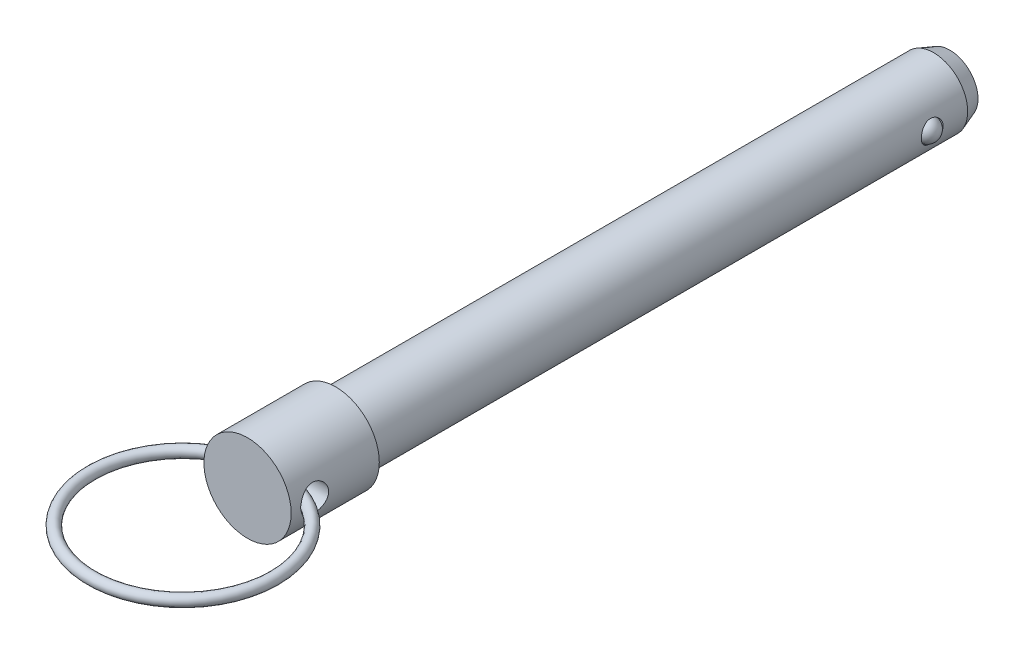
ISO-10303-21;
HEADER;
FILE_DESCRIPTION(('STEP AP214'),'2;1');
FILE_NAME('part.step','',(''),(''),'','','');
FILE_SCHEMA(('AUTOMOTIVE_DESIGN { 1 0 10303 214 1 1 1 1 }'));
ENDSEC;
DATA;
#1=APPLICATION_CONTEXT('core data for automotive mechanical design processes');
#2=APPLICATION_PROTOCOL_DEFINITION('international standard','automotive_design',2000,#1);
#3=PRODUCT_CONTEXT('',#1,'mechanical');
#4=PRODUCT('Part','Part','',(#3));
#5=PRODUCT_RELATED_PRODUCT_CATEGORY('part','',(#4));
#6=PRODUCT_DEFINITION_FORMATION('','',#4);
#7=PRODUCT_DEFINITION_CONTEXT('part definition',#1,'design');
#8=PRODUCT_DEFINITION('design','',#6,#7);
#9=PRODUCT_DEFINITION_SHAPE('','',#8);
#10=(LENGTH_UNIT() NAMED_UNIT(*) SI_UNIT(.MILLI.,.METRE.));
#11=(NAMED_UNIT(*) PLANE_ANGLE_UNIT() SI_UNIT($,.RADIAN.));
#12=(NAMED_UNIT(*) SI_UNIT($,.STERADIAN.) SOLID_ANGLE_UNIT());
#13=UNCERTAINTY_MEASURE_WITH_UNIT(LENGTH_MEASURE(1.E-05),#10,'distance_accuracy_value','');
#14=(GEOMETRIC_REPRESENTATION_CONTEXT(3) GLOBAL_UNCERTAINTY_ASSIGNED_CONTEXT((#13)) GLOBAL_UNIT_ASSIGNED_CONTEXT((#10,
#11,#12)) REPRESENTATION_CONTEXT('',''));
#15=CARTESIAN_POINT('',(0.,0.,0.));
#16=DIRECTION('',(0.,0.,1.));
#17=DIRECTION('',(1.,0.,0.));
#18=AXIS2_PLACEMENT_3D('',#15,#16,#17);
#19=CARTESIAN_POINT('',(7.9375,0.,9.398));
#20=DIRECTION('',(-1.,0.,0.));
#21=DIRECTION('',(0.,0.,-1.));
#22=AXIS2_PLACEMENT_3D('',#19,#20,#21);
#23=CYLINDRICAL_SURFACE('',#22,2.0193);
#24=CARTESIAN_POINT('',(-6.3502,0.292157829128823,11.3960531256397));
#25=CARTESIAN_POINT('',(-6.33446408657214,0.262361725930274,11.4004344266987));
#26=CARTESIAN_POINT('',(-6.32102794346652,0.231225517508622,11.4042829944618));
#27=CARTESIAN_POINT('',(-6.2992523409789,0.167152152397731,11.4106204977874));
#28=CARTESIAN_POINT('',(-6.29090461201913,0.134218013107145,11.413111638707));
#29=CARTESIAN_POINT('',(-6.2797291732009,0.0672091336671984,11.4164621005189));
#30=CARTESIAN_POINT('',(-6.27692077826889,0.033130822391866,11.4173157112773));
#31=CARTESIAN_POINT('',(-6.27702601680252,-0.0350157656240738,11.4172838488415));
#32=CARTESIAN_POINT('',(-6.27993956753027,-0.0690840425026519,11.4163984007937));
#33=CARTESIAN_POINT('',(-6.29126629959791,-0.135748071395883,11.4130038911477));
#34=CARTESIAN_POINT('',(-6.2996097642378,-0.168356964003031,11.4105154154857));
#35=CARTESIAN_POINT('',(-6.32127848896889,-0.23180278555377,11.404211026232));
#36=CARTESIAN_POINT('',(-6.33461136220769,-0.262636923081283,11.4003930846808));
#37=CARTESIAN_POINT('',(-6.3502,-0.292157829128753,11.3960531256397));
#38=B_SPLINE_CURVE_WITH_KNOTS('',3,(#24,#25,#26,#27,#28,#29,#30,#31,#32,#33,#34,#35,#36,#37),
.UNSPECIFIED.,.F.,.F.,(4,2,2,2,2,2,4),(0.,0.101899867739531,0.203633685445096,0.305721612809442,
0.407808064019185,0.508608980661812,0.609564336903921),.UNSPECIFIED.);
#39=CARTESIAN_POINT('',(-6.3438349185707,0.279747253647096,11.3978284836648));
#40=VERTEX_POINT('',#39);
#41=CARTESIAN_POINT('',(-6.34383491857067,-0.279747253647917,11.3978284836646));
#42=VERTEX_POINT('',#41);
#43=EDGE_CURVE('E40',#40,#42,#38,.T.);
#44=ORIENTED_EDGE('',*,*,#43,.F.);
#45=CARTESIAN_POINT('',(-6.35,0.,11.4173));
#46=CARTESIAN_POINT('',(-6.34999578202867,-0.110312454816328,11.417293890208));
#47=CARTESIAN_POINT('',(-6.34709412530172,-0.220741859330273,11.4082188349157));
#48=CARTESIAN_POINT('',(-6.3357852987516,-0.438477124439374,11.3722159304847));
#49=CARTESIAN_POINT('',(-6.3273687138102,-0.545777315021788,11.3452575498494));
#50=CARTESIAN_POINT('',(-6.30595235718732,-0.753914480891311,11.2744960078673));
#51=CARTESIAN_POINT('',(-6.29296259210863,-0.85476500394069,11.2307296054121));
#52=CARTESIAN_POINT('',(-6.26374009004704,-1.04765917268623,11.1277235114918));
#53=CARTESIAN_POINT('',(-6.24750783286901,-1.13970411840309,11.0684861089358));
#54=CARTESIAN_POINT('',(-6.2129360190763,-1.31536123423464,10.9342184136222));
#55=CARTESIAN_POINT('',(-6.19454917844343,-1.39865352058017,10.8587818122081));
#56=CARTESIAN_POINT('',(-6.15801023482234,-1.55164747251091,10.6951184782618));
#57=CARTESIAN_POINT('',(-6.13985819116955,-1.62134576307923,10.606888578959));
#58=CARTESIAN_POINT('',(-6.1053372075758,-1.74691684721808,10.4173629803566));
#59=CARTESIAN_POINT('',(-6.08902613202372,-1.80238797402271,10.315789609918));
#60=CARTESIAN_POINT('',(-6.06074349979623,-1.89532725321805,10.104153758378));
#61=CARTESIAN_POINT('',(-6.04877073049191,-1.93280043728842,9.99409365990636));
#62=CARTESIAN_POINT('',(-6.03101341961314,-1.9875076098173,9.77220930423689));
#63=CARTESIAN_POINT('',(-6.0250482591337,-2.00533395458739,9.66054596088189));
#64=CARTESIAN_POINT('',(-6.01944581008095,-2.02209234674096,9.43566621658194));
#65=CARTESIAN_POINT('',(-6.01980677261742,-2.02102961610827,9.32245025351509));
#66=CARTESIAN_POINT('',(-6.02665663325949,-2.0005025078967,9.10261826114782));
#67=CARTESIAN_POINT('',(-6.03289303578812,-1.98179631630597,8.99592223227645));
#68=CARTESIAN_POINT('',(-6.05038018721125,-1.92774435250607,8.78726894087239));
#69=CARTESIAN_POINT('',(-6.06163151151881,-1.89239667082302,8.68531222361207));
#70=CARTESIAN_POINT('',(-6.08807105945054,-1.80553890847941,8.48724541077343));
#71=CARTESIAN_POINT('',(-6.1033159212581,-1.75379385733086,8.39124624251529));
#72=CARTESIAN_POINT('',(-6.13599834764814,-1.63577635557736,8.20905256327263));
#73=CARTESIAN_POINT('',(-6.15343637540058,-1.56950083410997,8.12286013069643));
#74=CARTESIAN_POINT('',(-6.18954615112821,-1.42061516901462,7.95845350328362));
#75=CARTESIAN_POINT('',(-6.20823733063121,-1.33738288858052,7.88080597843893));
#76=CARTESIAN_POINT('',(-6.2440320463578,-1.15881168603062,7.74040227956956));
#77=CARTESIAN_POINT('',(-6.26113489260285,-1.06346754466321,7.67765255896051));
#78=CARTESIAN_POINT('',(-6.29201953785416,-0.862230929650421,7.56842117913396));
#79=CARTESIAN_POINT('',(-6.30576997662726,-0.756251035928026,7.5220914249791));
#80=CARTESIAN_POINT('',(-6.32815272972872,-0.537579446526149,7.448167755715));
#81=CARTESIAN_POINT('',(-6.3367955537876,-0.42490206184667,7.4205353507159));
#82=CARTESIAN_POINT('',(-6.34491251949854,-0.259333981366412,7.39474486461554));
#83=CARTESIAN_POINT('',(-6.3468148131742,-0.207677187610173,7.38873516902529));
#84=CARTESIAN_POINT('',(-6.34935954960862,-0.104022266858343,7.38071129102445));
#85=CARTESIAN_POINT('',(-6.35000198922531,-0.0520241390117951,7.37869711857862));
#86=CARTESIAN_POINT('',(-6.34999578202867,0.110312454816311,7.37870610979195));
#87=CARTESIAN_POINT('',(-6.34709412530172,0.220741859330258,7.38778116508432));
#88=CARTESIAN_POINT('',(-6.33578529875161,0.438477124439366,7.4237840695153));
#89=CARTESIAN_POINT('',(-6.32736871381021,0.545777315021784,7.45074245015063));
#90=CARTESIAN_POINT('',(-6.30595235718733,0.753914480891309,7.52150399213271));
#91=CARTESIAN_POINT('',(-6.29296259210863,0.854765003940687,7.56527039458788));
#92=CARTESIAN_POINT('',(-6.26374009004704,1.04765917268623,7.66827648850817));
#93=CARTESIAN_POINT('',(-6.24750783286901,1.13970411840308,7.72751389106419));
#94=CARTESIAN_POINT('',(-6.2129360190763,1.31536123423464,7.86178158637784));
#95=CARTESIAN_POINT('',(-6.19454917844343,1.39865352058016,7.93721818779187));
#96=CARTESIAN_POINT('',(-6.15801023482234,1.55164747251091,8.10088152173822));
#97=CARTESIAN_POINT('',(-6.13985819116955,1.62134576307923,8.18911142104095));
#98=CARTESIAN_POINT('',(-6.1053372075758,1.74691684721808,8.37863701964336));
#99=CARTESIAN_POINT('',(-6.08902613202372,1.80238797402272,8.48021039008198));
#100=CARTESIAN_POINT('',(-6.06074349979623,1.89532725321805,8.69184624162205));
#101=CARTESIAN_POINT('',(-6.04877073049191,1.93280043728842,8.80190634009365));
#102=CARTESIAN_POINT('',(-6.03101341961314,1.9875076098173,9.02379069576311));
#103=CARTESIAN_POINT('',(-6.0250482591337,2.00533395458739,9.13545403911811));
#104=CARTESIAN_POINT('',(-6.01944581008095,2.02209234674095,9.36033378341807));
#105=CARTESIAN_POINT('',(-6.01980677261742,2.02102961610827,9.47354974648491));
#106=CARTESIAN_POINT('',(-6.02665663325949,2.00050250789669,9.69338173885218));
#107=CARTESIAN_POINT('',(-6.03289303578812,1.98179631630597,9.80007776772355));
#108=CARTESIAN_POINT('',(-6.05038018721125,1.92774435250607,10.0087310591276));
#109=CARTESIAN_POINT('',(-6.06163151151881,1.89239667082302,10.1106877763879));
#110=CARTESIAN_POINT('',(-6.08807105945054,1.80553890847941,10.3087545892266));
#111=CARTESIAN_POINT('',(-6.1033159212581,1.75379385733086,10.4047537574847));
#112=CARTESIAN_POINT('',(-6.13599834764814,1.63577635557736,10.5869474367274));
#113=CARTESIAN_POINT('',(-6.15343637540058,1.56950083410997,10.6731398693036));
#114=CARTESIAN_POINT('',(-6.18954615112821,1.42061516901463,10.8375464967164));
#115=CARTESIAN_POINT('',(-6.20823733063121,1.33738288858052,10.9151940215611));
#116=CARTESIAN_POINT('',(-6.2440320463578,1.15881168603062,11.0555977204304));
#117=CARTESIAN_POINT('',(-6.26113489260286,1.06346754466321,11.1183474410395));
#118=CARTESIAN_POINT('',(-6.29201953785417,0.862230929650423,11.227578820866));
#119=CARTESIAN_POINT('',(-6.30576997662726,0.756251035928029,11.2739085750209));
#120=CARTESIAN_POINT('',(-6.32815272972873,0.53757944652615,11.347832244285));
#121=CARTESIAN_POINT('',(-6.33679555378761,0.424902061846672,11.3754646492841));
#122=CARTESIAN_POINT('',(-6.34491251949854,0.25933398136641,11.4012551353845));
#123=CARTESIAN_POINT('',(-6.34681481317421,0.207677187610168,11.4072648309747));
#124=CARTESIAN_POINT('',(-6.34935954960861,0.10402226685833,11.4152887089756));
#125=CARTESIAN_POINT('',(-6.35000198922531,0.0520241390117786,11.4173028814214));
#126=CARTESIAN_POINT('',(-6.35,0.,11.4173));
#127=B_SPLINE_CURVE_WITH_KNOTS('',3,(#45,#46,#47,#48,#49,#50,#51,#52,#53,#54,#55,#56,#57,#58,
#59,#60,#61,#62,#63,#64,#65,#66,#67,#68,#69,#70,#71,#72,#73,#74,#75,#76,#77,#78,#79,#80,#81,#82,
#83,#84,#85,#86,#87,#88,#89,#90,#91,#92,#93,#94,#95,#96,#97,#98,#99,#100,#101,#102,#103,#104,
#105,#106,#107,#108,#109,#110,#111,#112,#113,#114,#115,#116,#117,#118,#119,#120,#121,#122,#123,
#124,#125,#126),.UNSPECIFIED.,.T.,.F.,(4,2,2,2,2,2,2,2,2,2,2,2,2,2,2,2,2,2,2,2,2,2,2,2,2,2,2,2,
2,2,2,2,2,2,2,2,2,2,2,2,4),(0.,0.33073688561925,0.662039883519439,0.992622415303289,
1.32315606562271,1.66322530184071,2.00337886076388,2.35228054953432,2.70108463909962,
3.0390572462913,3.37693642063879,3.70092724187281,4.02495524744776,4.35385413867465,
4.68282260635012,5.02727904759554,5.37188442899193,5.71959937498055,6.06659632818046,
6.22257380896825,6.37855167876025,6.70928856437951,7.04059156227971,7.37117409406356,
7.70170774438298,8.04177698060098,8.38193053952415,8.73083222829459,9.0796363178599,
9.41760892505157,9.75548809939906,10.0794789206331,10.403506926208,10.7324058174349,
11.0613742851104,11.4058307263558,11.7504361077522,12.0981510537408,12.4451480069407,
12.6011254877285,12.7571033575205),.UNSPECIFIED.);
#128=EDGE_CURVE('E66',#42,#40,#127,.T.);
#129=ORIENTED_EDGE('',*,*,#128,.F.);
#130=EDGE_LOOP('',(#44,#129));
#131=FACE_BOUND('',#130,.T.);
#132=CARTESIAN_POINT('',(6.3502,-0.292157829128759,11.3960531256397));
#133=CARTESIAN_POINT('',(6.33446408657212,-0.262361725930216,11.4004344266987));
#134=CARTESIAN_POINT('',(6.32102794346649,-0.231225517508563,11.4042829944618));
#135=CARTESIAN_POINT('',(6.29925234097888,-0.16715215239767,11.4106204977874));
#136=CARTESIAN_POINT('',(6.29090461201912,-0.134218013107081,11.413111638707));
#137=CARTESIAN_POINT('',(6.27972917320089,-0.0672091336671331,11.4164621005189));
#138=CARTESIAN_POINT('',(6.27692077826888,-0.0331308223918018,11.4173157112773));
#139=CARTESIAN_POINT('',(6.27702601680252,0.0350157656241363,11.4172838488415));
#140=CARTESIAN_POINT('',(6.27993956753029,0.0690840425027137,11.4163984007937));
#141=CARTESIAN_POINT('',(6.29126629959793,0.135748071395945,11.4130038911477));
#142=CARTESIAN_POINT('',(6.29960976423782,0.168356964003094,11.4105154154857));
#143=CARTESIAN_POINT('',(6.3212784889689,0.231802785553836,11.4042110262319));
#144=CARTESIAN_POINT('',(6.3346113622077,0.262636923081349,11.4003930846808));
#145=CARTESIAN_POINT('',(6.3502,0.292157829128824,11.3960531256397));
#146=B_SPLINE_CURVE_WITH_KNOTS('',3,(#132,#133,#134,#135,#136,#137,#138,#139,#140,#141,#142,
#143,#144,#145),.UNSPECIFIED.,.F.,.F.,(4,2,2,2,2,2,4),(0.,0.101899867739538,0.203633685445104,
0.305721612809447,0.40780806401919,0.508608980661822,0.609564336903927),.UNSPECIFIED.);
#147=CARTESIAN_POINT('',(6.3438349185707,-0.279747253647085,11.3978284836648));
#148=VERTEX_POINT('',#147);
#149=CARTESIAN_POINT('',(6.34383491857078,0.279747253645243,11.397828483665));
#150=VERTEX_POINT('',#149);
#151=EDGE_CURVE('E33',#148,#150,#146,.T.);
#152=ORIENTED_EDGE('',*,*,#151,.F.);
#153=CARTESIAN_POINT('',(6.35,0.,7.3787));
#154=CARTESIAN_POINT('',(6.34999578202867,-0.110312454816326,7.37870610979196));
#155=CARTESIAN_POINT('',(6.34709412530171,-0.22074185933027,7.38778116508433));
#156=CARTESIAN_POINT('',(6.3357852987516,-0.438477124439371,7.4237840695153));
#157=CARTESIAN_POINT('',(6.32736871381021,-0.545777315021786,7.45074245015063));
#158=CARTESIAN_POINT('',(6.30595235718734,-0.753914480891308,7.52150399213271));
#159=CARTESIAN_POINT('',(6.29296259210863,-0.854765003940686,7.56527039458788));
#160=CARTESIAN_POINT('',(6.26374009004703,-1.04765917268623,7.66827648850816));
#161=CARTESIAN_POINT('',(6.247507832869,-1.13970411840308,7.72751389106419));
#162=CARTESIAN_POINT('',(6.21293601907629,-1.31536123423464,7.86178158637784));
#163=CARTESIAN_POINT('',(6.19454917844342,-1.39865352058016,7.93721818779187));
#164=CARTESIAN_POINT('',(6.15801023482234,-1.55164747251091,8.10088152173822));
#165=CARTESIAN_POINT('',(6.13985819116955,-1.62134576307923,8.18911142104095));
#166=CARTESIAN_POINT('',(6.1053372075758,-1.74691684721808,8.37863701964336));
#167=CARTESIAN_POINT('',(6.08902613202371,-1.80238797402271,8.48021039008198));
#168=CARTESIAN_POINT('',(6.06074349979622,-1.89532725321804,8.69184624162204));
#169=CARTESIAN_POINT('',(6.04877073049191,-1.93280043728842,8.80190634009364));
#170=CARTESIAN_POINT('',(6.03101341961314,-1.9875076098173,9.02379069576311));
#171=CARTESIAN_POINT('',(6.02504825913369,-2.00533395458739,9.13545403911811));
#172=CARTESIAN_POINT('',(6.01944581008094,-2.02209234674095,9.36033378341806));
#173=CARTESIAN_POINT('',(6.01980677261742,-2.02102961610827,9.47354974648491));
#174=CARTESIAN_POINT('',(6.02665663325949,-2.00050250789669,9.69338173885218));
#175=CARTESIAN_POINT('',(6.03289303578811,-1.98179631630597,9.80007776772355));
#176=CARTESIAN_POINT('',(6.05038018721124,-1.92774435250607,10.0087310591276));
#177=CARTESIAN_POINT('',(6.06163151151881,-1.89239667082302,10.1106877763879));
#178=CARTESIAN_POINT('',(6.08807105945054,-1.80553890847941,10.3087545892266));
#179=CARTESIAN_POINT('',(6.1033159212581,-1.75379385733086,10.4047537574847));
#180=CARTESIAN_POINT('',(6.13599834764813,-1.63577635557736,10.5869474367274));
#181=CARTESIAN_POINT('',(6.15343637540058,-1.56950083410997,10.6731398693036));
#182=CARTESIAN_POINT('',(6.18954615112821,-1.42061516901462,10.8375464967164));
#183=CARTESIAN_POINT('',(6.2082373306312,-1.33738288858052,10.9151940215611));
#184=CARTESIAN_POINT('',(6.24403204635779,-1.15881168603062,11.0555977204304));
#185=CARTESIAN_POINT('',(6.26113489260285,-1.06346754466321,11.1183474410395));
#186=CARTESIAN_POINT('',(6.29201953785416,-0.862230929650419,11.227578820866));
#187=CARTESIAN_POINT('',(6.30576997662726,-0.756251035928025,11.2739085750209));
#188=CARTESIAN_POINT('',(6.32815272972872,-0.537579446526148,11.347832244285));
#189=CARTESIAN_POINT('',(6.3367955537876,-0.424902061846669,11.3754646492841));
#190=CARTESIAN_POINT('',(6.34491251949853,-0.25933398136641,11.4012551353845));
#191=CARTESIAN_POINT('',(6.3468148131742,-0.207677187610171,11.4072648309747));
#192=CARTESIAN_POINT('',(6.34935954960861,-0.10402226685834,11.4152887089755));
#193=CARTESIAN_POINT('',(6.35000198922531,-0.0520241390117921,11.4173028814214));
#194=CARTESIAN_POINT('',(6.34999578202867,0.110312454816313,11.417293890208));
#195=CARTESIAN_POINT('',(6.34709412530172,0.220741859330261,11.4082188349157));
#196=CARTESIAN_POINT('',(6.33578529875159,0.438477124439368,11.3722159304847));
#197=CARTESIAN_POINT('',(6.3273687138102,0.545777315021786,11.3452575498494));
#198=CARTESIAN_POINT('',(6.30595235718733,0.753914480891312,11.2744960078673));
#199=CARTESIAN_POINT('',(6.29296259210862,0.854765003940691,11.2307296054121));
#200=CARTESIAN_POINT('',(6.26374009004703,1.04765917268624,11.1277235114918));
#201=CARTESIAN_POINT('',(6.247507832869,1.13970411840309,11.0684861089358));
#202=CARTESIAN_POINT('',(6.21293601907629,1.31536123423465,10.9342184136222));
#203=CARTESIAN_POINT('',(6.19454917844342,1.39865352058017,10.8587818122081));
#204=CARTESIAN_POINT('',(6.15801023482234,1.55164747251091,10.6951184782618));
#205=CARTESIAN_POINT('',(6.13985819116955,1.62134576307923,10.606888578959));
#206=CARTESIAN_POINT('',(6.1053372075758,1.74691684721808,10.4173629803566));
#207=CARTESIAN_POINT('',(6.08902613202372,1.80238797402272,10.315789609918));
#208=CARTESIAN_POINT('',(6.06074349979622,1.89532725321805,10.104153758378));
#209=CARTESIAN_POINT('',(6.0487707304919,1.93280043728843,9.99409365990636));
#210=CARTESIAN_POINT('',(6.03101341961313,1.9875076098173,9.77220930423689));
#211=CARTESIAN_POINT('',(6.02504825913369,2.0053339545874,9.66054596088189));
#212=CARTESIAN_POINT('',(6.01944581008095,2.02209234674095,9.43566621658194));
#213=CARTESIAN_POINT('',(6.01980677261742,2.02102961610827,9.32245025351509));
#214=CARTESIAN_POINT('',(6.02665663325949,2.00050250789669,9.10261826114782));
#215=CARTESIAN_POINT('',(6.03289303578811,1.98179631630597,8.99592223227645));
#216=CARTESIAN_POINT('',(6.05038018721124,1.92774435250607,8.78726894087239));
#217=CARTESIAN_POINT('',(6.06163151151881,1.89239667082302,8.68531222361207));
#218=CARTESIAN_POINT('',(6.08807105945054,1.80553890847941,8.48724541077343));
#219=CARTESIAN_POINT('',(6.1033159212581,1.75379385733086,8.39124624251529));
#220=CARTESIAN_POINT('',(6.13599834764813,1.63577635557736,8.20905256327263));
#221=CARTESIAN_POINT('',(6.15343637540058,1.56950083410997,8.12286013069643));
#222=CARTESIAN_POINT('',(6.18954615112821,1.42061516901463,7.95845350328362));
#223=CARTESIAN_POINT('',(6.2082373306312,1.33738288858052,7.88080597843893));
#224=CARTESIAN_POINT('',(6.24403204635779,1.15881168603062,7.74040227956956));
#225=CARTESIAN_POINT('',(6.26113489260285,1.06346754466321,7.67765255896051));
#226=CARTESIAN_POINT('',(6.29201953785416,0.862230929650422,7.56842117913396));
#227=CARTESIAN_POINT('',(6.30576997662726,0.756251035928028,7.5220914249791));
#228=CARTESIAN_POINT('',(6.32815272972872,0.53757944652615,7.448167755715));
#229=CARTESIAN_POINT('',(6.3367955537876,0.424902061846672,7.4205353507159));
#230=CARTESIAN_POINT('',(6.34491251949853,0.25933398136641,7.39474486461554));
#231=CARTESIAN_POINT('',(6.3468148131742,0.207677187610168,7.38873516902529));
#232=CARTESIAN_POINT('',(6.34935954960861,0.104022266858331,7.38071129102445));
#233=CARTESIAN_POINT('',(6.35000198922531,0.0520241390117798,7.37869711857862));
#234=CARTESIAN_POINT('',(6.35,0.,7.3787));
#235=B_SPLINE_CURVE_WITH_KNOTS('',3,(#153,#154,#155,#156,#157,#158,#159,#160,#161,#162,#163,
#164,#165,#166,#167,#168,#169,#170,#171,#172,#173,#174,#175,#176,#177,#178,#179,#180,#181,#182,
#183,#184,#185,#186,#187,#188,#189,#190,#191,#192,#193,#194,#195,#196,#197,#198,#199,#200,#201,
#202,#203,#204,#205,#206,#207,#208,#209,#210,#211,#212,#213,#214,#215,#216,#217,#218,#219,#220,
#221,#222,#223,#224,#225,#226,#227,#228,#229,#230,#231,#232,#233,#234),.UNSPECIFIED.,.T.,.F.,(4,
2,2,2,2,2,2,2,2,2,2,2,2,2,2,2,2,2,2,2,2,2,2,2,2,2,2,2,2,2,2,2,2,2,2,2,2,2,2,2,4),(0.,
0.330736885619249,0.662039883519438,0.992622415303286,1.32315606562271,1.66322530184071,
2.00337886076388,2.35228054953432,2.70108463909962,3.0390572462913,3.37693642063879,
3.7009272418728,4.02495524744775,4.35385413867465,4.68282260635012,5.02727904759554,
5.37188442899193,5.71959937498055,6.06659632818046,6.22257380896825,6.37855167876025,
6.70928856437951,7.04059156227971,7.37117409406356,7.70170774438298,8.04177698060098,
8.38193053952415,8.73083222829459,9.07963631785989,9.41760892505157,9.75548809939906,
10.0794789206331,10.403506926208,10.7324058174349,11.0613742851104,11.4058307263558,
11.7504361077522,12.0981510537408,12.4451480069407,12.6011254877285,12.7571033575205),.UNSPECIFIED.);
#236=EDGE_CURVE('E62',#150,#148,#235,.T.);
#237=ORIENTED_EDGE('',*,*,#236,.F.);
#238=EDGE_LOOP('',(#152,#237));
#239=FACE_BOUND('',#238,.T.);
#240=ADVANCED_FACE('F14',(#131,#239),#23,.F.);
#241=CARTESIAN_POINT('',(0.,0.,-34.39922));
#242=DIRECTION('',(0.,0.,-1.));
#243=DIRECTION('',(1.,0.,0.));
#244=AXIS2_PLACEMENT_3D('',#241,#242,#243);
#245=CYLINDRICAL_SURFACE('',#244,6.35);
#246=ORIENTED_EDGE('',*,*,#236,.T.);
#247=CARTESIAN_POINT('',(6.34911067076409,-0.106292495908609,9.64531337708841));
#248=CARTESIAN_POINT('',(6.3483941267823,-0.149074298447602,9.65137725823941));
#249=CARTESIAN_POINT('',(6.34724965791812,-0.191344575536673,9.66110939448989));
#250=CARTESIAN_POINT('',(6.34423605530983,-0.273618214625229,9.68758101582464));
#251=CARTESIAN_POINT('',(6.34236646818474,-0.3136201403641,9.704324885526));
#252=CARTESIAN_POINT('',(6.3381174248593,-0.390175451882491,9.74421775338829));
#253=CARTESIAN_POINT('',(6.33573876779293,-0.42673411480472,9.76735672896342));
#254=CARTESIAN_POINT('',(6.33072830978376,-0.495552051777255,9.8192835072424));
#255=CARTESIAN_POINT('',(6.32809652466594,-0.527811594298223,9.84807095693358));
#256=CARTESIAN_POINT('',(6.32277775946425,-0.588154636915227,9.91124388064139));
#257=CARTESIAN_POINT('',(6.32009122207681,-0.616100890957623,9.94576018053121));
#258=CARTESIAN_POINT('',(6.31500218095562,-0.666246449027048,10.0187508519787));
#259=CARTESIAN_POINT('',(6.31259974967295,-0.688444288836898,10.0572262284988));
#260=CARTESIAN_POINT('',(6.30814194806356,-0.72820004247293,10.1398945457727));
#261=CARTESIAN_POINT('',(6.30612298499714,-0.745320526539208,10.1842993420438));
#262=CARTESIAN_POINT('',(6.30283333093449,-0.772645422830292,10.2752074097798));
#263=CARTESIAN_POINT('',(6.30156294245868,-0.782847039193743,10.3217115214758));
#264=CARTESIAN_POINT('',(6.2997729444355,-0.797132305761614,10.4203656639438));
#265=CARTESIAN_POINT('',(6.29934001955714,-0.800511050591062,10.4726191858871));
#266=CARTESIAN_POINT('',(6.29948539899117,-0.799363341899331,10.5770343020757));
#267=CARTESIAN_POINT('',(6.30006412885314,-0.79483356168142,10.6291958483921));
#268=CARTESIAN_POINT('',(6.30224519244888,-0.777362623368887,10.7373900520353));
#269=CARTESIAN_POINT('',(6.30394321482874,-0.763632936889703,10.7932945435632));
#270=CARTESIAN_POINT('',(6.3082304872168,-0.727364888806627,10.9021925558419));
#271=CARTESIAN_POINT('',(6.31082057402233,-0.704818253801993,10.9551832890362));
#272=CARTESIAN_POINT('',(6.31668084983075,-0.65024958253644,11.058462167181));
#273=CARTESIAN_POINT('',(6.31997188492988,-0.617920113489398,11.108588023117));
#274=CARTESIAN_POINT('',(6.32672369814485,-0.544444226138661,11.2018715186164));
#275=CARTESIAN_POINT('',(6.33018413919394,-0.503314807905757,11.2450423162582));
#276=CARTESIAN_POINT('',(6.33576833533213,-0.426106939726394,11.3105875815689));
#277=CARTESIAN_POINT('',(6.3379874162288,-0.392058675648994,11.3353540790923));
#278=CARTESIAN_POINT('',(6.34201635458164,-0.320334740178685,11.378985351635));
#279=CARTESIAN_POINT('',(6.34382654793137,-0.282662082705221,11.3978549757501));
#280=CARTESIAN_POINT('',(6.34683709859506,-0.204222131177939,11.4286907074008));
#281=CARTESIAN_POINT('',(6.34803303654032,-0.163434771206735,11.4406068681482));
#282=CARTESIAN_POINT('',(6.34962760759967,-0.0803154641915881,11.456409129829));
#283=CARTESIAN_POINT('',(6.35002678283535,-0.037984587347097,11.4603006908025));
#284=CARTESIAN_POINT('',(6.34997361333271,0.0416311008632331,11.4597766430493));
#285=CARTESIAN_POINT('',(6.34961570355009,0.0789250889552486,11.4562823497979));
#286=CARTESIAN_POINT('',(6.34827799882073,0.152365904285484,11.4430416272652));
#287=CARTESIAN_POINT('',(6.34729819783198,0.188512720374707,11.4332951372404));
#288=CARTESIAN_POINT('',(6.34483463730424,0.258437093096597,11.4082426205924));
#289=CARTESIAN_POINT('',(6.34335520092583,0.292232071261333,11.392984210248));
#290=CARTESIAN_POINT('',(6.3400309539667,0.357164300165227,11.3576448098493));
#291=CARTESIAN_POINT('',(6.33818602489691,0.388300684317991,11.3375622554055));
#292=CARTESIAN_POINT('',(6.33403341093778,0.451264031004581,11.2905464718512));
#293=CARTESIAN_POINT('',(6.33169671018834,0.482680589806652,11.2630681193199));
#294=CARTESIAN_POINT('',(6.32695276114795,0.541327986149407,11.2039742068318));
#295=CARTESIAN_POINT('',(6.32454547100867,0.56855627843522,11.1723561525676));
#296=CARTESIAN_POINT('',(6.31940966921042,0.623257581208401,11.0997303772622));
#297=CARTESIAN_POINT('',(6.31670324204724,0.649859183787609,11.0580641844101));
#298=CARTESIAN_POINT('',(6.31169900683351,0.696787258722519,10.9713122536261));
#299=CARTESIAN_POINT('',(6.30940147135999,0.71710955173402,10.9262242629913));
#300=CARTESIAN_POINT('',(6.30511939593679,0.753900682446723,10.8265682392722));
#301=CARTESIAN_POINT('',(6.30323580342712,0.769311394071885,10.7716021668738));
#302=CARTESIAN_POINT('',(6.30052520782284,0.79120402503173,10.6598731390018));
#303=CARTESIAN_POINT('',(6.2996986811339,0.79768191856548,10.6031093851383));
#304=CARTESIAN_POINT('',(6.29923241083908,0.80136018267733,10.4867557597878));
#305=CARTESIAN_POINT('',(6.2996462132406,0.798141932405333,10.4271509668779));
#306=CARTESIAN_POINT('',(6.30178827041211,0.781050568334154,10.3094933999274));
#307=CARTESIAN_POINT('',(6.30351599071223,0.767181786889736,10.2514400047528));
#308=CARTESIAN_POINT('',(6.30793273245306,0.729936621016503,10.1430301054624));
#309=CARTESIAN_POINT('',(6.31054579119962,0.707295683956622,10.0924193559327));
#310=CARTESIAN_POINT('',(6.316412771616,0.652821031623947,9.9964473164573));
#311=CARTESIAN_POINT('',(6.31966615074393,0.620995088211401,9.95108163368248));
#312=CARTESIAN_POINT('',(6.3259599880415,0.552954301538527,9.87232840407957));
#313=CARTESIAN_POINT('',(6.32898344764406,0.517631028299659,9.83816824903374));
#314=CARTESIAN_POINT('',(6.33476504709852,0.441261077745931,9.77694761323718));
#315=CARTESIAN_POINT('',(6.33752330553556,0.400216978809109,9.74988394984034));
#316=CARTESIAN_POINT('',(6.34218417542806,0.317440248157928,9.70596453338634));
#317=CARTESIAN_POINT('',(6.34413984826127,0.276067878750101,9.68843287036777));
#318=CARTESIAN_POINT('',(6.34727291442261,0.190881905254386,9.66089843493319));
#319=CARTESIAN_POINT('',(6.34845102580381,0.147070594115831,9.65088871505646));
#320=CARTESIAN_POINT('',(6.34972965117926,0.0681015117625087,9.64007587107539));
#321=CARTESIAN_POINT('',(6.35000959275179,0.0331486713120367,9.63773711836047));
#322=CARTESIAN_POINT('',(6.34998989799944,-0.0367451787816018,9.63790342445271));
#323=CARTESIAN_POINT('',(6.34969028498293,-0.0716861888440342,9.64040828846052));
#324=CARTESIAN_POINT('',(6.34911067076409,-0.106292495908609,9.64531337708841));
#325=B_SPLINE_CURVE_WITH_KNOTS('',3,(#247,#248,#249,#250,#251,#252,#253,#254,#255,#256,#257,
#258,#259,#260,#261,#262,#263,#264,#265,#266,#267,#268,#269,#270,#271,#272,#273,#274,#275,#276,
#277,#278,#279,#280,#281,#282,#283,#284,#285,#286,#287,#288,#289,#290,#291,#292,#293,#294,#295,
#296,#297,#298,#299,#300,#301,#302,#303,#304,#305,#306,#307,#308,#309,#310,#311,#312,#313,#314,
#315,#316,#317,#318,#319,#320,#321,#322,#323,#324),.UNSPECIFIED.,.T.,.F.,(4,2,2,2,2,2,2,2,2,2,2,
2,2,2,2,2,2,2,2,2,2,2,2,2,2,2,2,2,2,2,2,2,2,2,2,2,2,2,4),(0.,0.129515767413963,
0.259112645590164,0.388507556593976,0.517894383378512,0.650795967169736,0.783731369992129,
0.926038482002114,1.06840306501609,1.22484845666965,1.38135967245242,1.55336962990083,
1.72554138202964,1.90381365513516,2.08174459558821,2.20773649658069,2.33362451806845,
2.4604060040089,2.58710119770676,2.69892768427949,2.81075525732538,2.92163901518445,
3.03255877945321,3.15750232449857,3.28252150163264,3.4304749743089,3.57852670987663,
3.7491247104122,3.91979957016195,4.09794717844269,4.27602235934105,4.44160182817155,
4.60704160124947,4.7539407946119,4.90077399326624,5.03502725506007,5.1691563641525,
5.27392620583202,5.37869183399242),.UNSPECIFIED.);
#326=EDGE_CURVE('E27',#148,#150,#325,.T.);
#327=ORIENTED_EDGE('',*,*,#326,.T.);
#328=EDGE_LOOP('',(#246,#327));
#329=FACE_BOUND('',#328,.T.);
#330=CARTESIAN_POINT('',(0.,0.,12.8270000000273));
#331=DIRECTION('',(0.,0.,-1.));
#332=DIRECTION('',(1.,0.,0.));
#333=AXIS2_PLACEMENT_3D('',#330,#331,#332);
#334=CIRCLE('',#333,6.34999999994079);
#335=CARTESIAN_POINT('',(6.34999999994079,0.,12.8270000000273));
#336=VERTEX_POINT('',#335);
#337=EDGE_CURVE('E70',#336,#336,#334,.T.);
#338=ORIENTED_EDGE('',*,*,#337,.T.);
#339=EDGE_LOOP('',(#338));
#340=FACE_BOUND('',#339,.T.);
#341=CARTESIAN_POINT('',(0.,0.,1.16018306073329E-11));
#342=DIRECTION('',(0.,0.,-1.));
#343=DIRECTION('',(1.,0.,0.));
#344=AXIS2_PLACEMENT_3D('',#341,#342,#343);
#345=CIRCLE('',#344,6.34999999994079);
#346=CARTESIAN_POINT('',(6.34999999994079,0.,1.16015507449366E-11));
#347=VERTEX_POINT('',#346);
#348=EDGE_CURVE('E60',#347,#347,#345,.T.);
#349=ORIENTED_EDGE('',*,*,#348,.F.);
#350=EDGE_LOOP('',(#349));
#351=FACE_BOUND('',#350,.T.);
#352=ORIENTED_EDGE('',*,*,#128,.T.);
#353=CARTESIAN_POINT('',(-6.3491106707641,-0.106292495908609,9.64531337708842));
#354=CARTESIAN_POINT('',(-6.34981427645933,-0.0642492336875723,9.63935614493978));
#355=CARTESIAN_POINT('',(-6.35010491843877,-0.0216882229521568,9.63693832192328));
#356=CARTESIAN_POINT('',(-6.34982708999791,0.063245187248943,9.63926820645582));
#357=CARTESIAN_POINT('',(-6.34925830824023,0.105617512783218,9.64401851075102));
#358=CARTESIAN_POINT('',(-6.3473255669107,0.188929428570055,9.66052387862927));
#359=CARTESIAN_POINT('',(-6.34596206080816,0.229869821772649,9.67227494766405));
#360=CARTESIAN_POINT('',(-6.34259173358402,0.309205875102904,9.7023861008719));
#361=CARTESIAN_POINT('',(-6.34058494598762,0.347601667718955,9.72074584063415));
#362=CARTESIAN_POINT('',(-6.33612262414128,0.421219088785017,9.76368889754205));
#363=CARTESIAN_POINT('',(-6.33366281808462,0.456405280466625,9.78833239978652));
#364=CARTESIAN_POINT('',(-6.3285674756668,0.52233063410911,9.84295801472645));
#365=CARTESIAN_POINT('',(-6.32593191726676,0.553069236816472,9.87294079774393));
#366=CARTESIAN_POINT('',(-6.32063739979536,0.610668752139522,9.93869049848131));
#367=CARTESIAN_POINT('',(-6.31798210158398,0.637312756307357,9.97464737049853));
#368=CARTESIAN_POINT('',(-6.31302530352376,0.684675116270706,10.050284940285));
#369=CARTESIAN_POINT('',(-6.31072390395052,0.705391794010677,10.0899666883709));
#370=CARTESIAN_POINT('',(-6.3065253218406,0.742027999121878,10.1750481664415));
#371=CARTESIAN_POINT('',(-6.30467116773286,0.757473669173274,10.2206536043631));
#372=CARTESIAN_POINT('',(-6.30176158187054,0.781309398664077,10.3136897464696));
#373=CARTESIAN_POINT('',(-6.30070647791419,0.789696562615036,10.3611211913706));
#374=CARTESIAN_POINT('',(-6.29939708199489,0.800080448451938,10.4615517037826));
#375=CARTESIAN_POINT('',(-6.29923479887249,0.801343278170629,10.5146278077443));
#376=CARTESIAN_POINT('',(-6.29993274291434,0.795834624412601,10.6203535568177));
#377=CARTESIAN_POINT('',(-6.30079341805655,0.789059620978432,10.6730030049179));
#378=CARTESIAN_POINT('',(-6.30354435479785,0.766790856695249,10.7816321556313));
#379=CARTESIAN_POINT('',(-6.3055245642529,0.75053077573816,10.8374538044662));
#380=CARTESIAN_POINT('',(-6.3103170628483,0.709106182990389,10.9457204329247));
#381=CARTESIAN_POINT('',(-6.31313013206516,0.683933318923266,10.9981621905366));
#382=CARTESIAN_POINT('',(-6.31930287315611,0.624362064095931,11.0989766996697));
#383=CARTESIAN_POINT('',(-6.32267249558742,0.589786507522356,11.1472450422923));
#384=CARTESIAN_POINT('',(-6.32944316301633,0.512016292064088,11.2362287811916));
#385=CARTESIAN_POINT('',(-6.33284412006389,0.468841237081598,11.2769609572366));
#386=CARTESIAN_POINT('',(-6.3381447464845,0.389210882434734,11.3371705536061));
#387=CARTESIAN_POINT('',(-6.34018413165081,0.354783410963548,11.3593300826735));
#388=CARTESIAN_POINT('',(-6.34380499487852,0.282727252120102,11.3976985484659));
#389=CARTESIAN_POINT('',(-6.34538687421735,0.24510140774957,11.4139127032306));
#390=CARTESIAN_POINT('',(-6.34791613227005,0.16728046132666,11.4394899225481));
#391=CARTESIAN_POINT('',(-6.34885950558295,0.127070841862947,11.4488097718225));
#392=CARTESIAN_POINT('',(-6.34996657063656,0.0456031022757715,11.459723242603));
#393=CARTESIAN_POINT('',(-6.35013061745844,0.0043454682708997,11.4613203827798));
#394=CARTESIAN_POINT('',(-6.34968170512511,-0.0735082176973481,11.4569121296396));
#395=CARTESIAN_POINT('',(-6.34914631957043,-0.110150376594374,11.4516658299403));
#396=CARTESIAN_POINT('',(-6.34749195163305,-0.182042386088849,11.4351966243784));
#397=CARTESIAN_POINT('',(-6.3463729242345,-0.217292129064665,11.4239732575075));
#398=CARTESIAN_POINT('',(-6.34364878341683,-0.286046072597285,11.3959879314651));
#399=CARTESIAN_POINT('',(-6.34203717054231,-0.31951944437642,11.379151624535));
#400=CARTESIAN_POINT('',(-6.33848327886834,-0.383617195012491,11.3407750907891));
#401=CARTESIAN_POINT('',(-6.336540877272,-0.414240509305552,11.3192331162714));
#402=CARTESIAN_POINT('',(-6.33219640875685,-0.476327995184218,11.2689534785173));
#403=CARTESIAN_POINT('',(-6.32976799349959,-0.507315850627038,11.2396315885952));
#404=CARTESIAN_POINT('',(-6.32489282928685,-0.564859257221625,11.1769313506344));
#405=CARTESIAN_POINT('',(-6.32244606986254,-0.591412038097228,11.1435504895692));
#406=CARTESIAN_POINT('',(-6.31728331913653,-0.644412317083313,11.0671373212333));
#407=CARTESIAN_POINT('',(-6.31460099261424,-0.669935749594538,11.0234608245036));
#408=CARTESIAN_POINT('',(-6.3097291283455,-0.714365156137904,10.9328329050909));
#409=CARTESIAN_POINT('',(-6.30753991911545,-0.733266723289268,10.8858793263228));
#410=CARTESIAN_POINT('',(-6.30360262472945,-0.766429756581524,10.7829444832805));
#411=CARTESIAN_POINT('',(-6.30196031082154,-0.779660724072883,10.7266239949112));
#412=CARTESIAN_POINT('',(-6.29981098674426,-0.796841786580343,10.6125408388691));
#413=CARTESIAN_POINT('',(-6.29930438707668,-0.800788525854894,10.5547776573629));
#414=CARTESIAN_POINT('',(-6.29954116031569,-0.798927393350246,10.4378617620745));
#415=CARTESIAN_POINT('',(-6.30031766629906,-0.792860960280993,10.3787123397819));
#416=CARTESIAN_POINT('',(-6.3031448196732,-0.770063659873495,10.2625195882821));
#417=CARTESIAN_POINT('',(-6.30519479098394,-0.753338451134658,10.2054751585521));
#418=CARTESIAN_POINT('',(-6.31011127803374,-0.710921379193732,10.100203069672));
#419=CARTESIAN_POINT('',(-6.31289804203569,-0.686067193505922,10.0516355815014));
#420=CARTESIAN_POINT('',(-6.31897863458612,-0.627588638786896,9.96012359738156));
#421=CARTESIAN_POINT('',(-6.32227210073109,-0.59397052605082,9.91717512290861));
#422=CARTESIAN_POINT('',(-6.32851172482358,-0.52302859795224,9.84320836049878));
#423=CARTESIAN_POINT('',(-6.33145578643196,-0.486532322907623,9.81139456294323));
#424=CARTESIAN_POINT('',(-6.33697928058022,-0.408315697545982,9.75500457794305));
#425=CARTESIAN_POINT('',(-6.33955910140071,-0.36660100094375,9.73042065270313));
#426=CARTESIAN_POINT('',(-6.34352567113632,-0.288721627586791,9.69390061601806));
#427=CARTESIAN_POINT('',(-6.34504971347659,-0.253297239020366,9.68038073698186));
#428=CARTESIAN_POINT('',(-6.34752864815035,-0.18081626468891,9.65874203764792));
#429=CARTESIAN_POINT('',(-6.34848364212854,-0.143759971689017,9.65062225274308));
#430=CARTESIAN_POINT('',(-6.3491106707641,-0.106292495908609,9.64531337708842));
#431=B_SPLINE_CURVE_WITH_KNOTS('',3,(#353,#354,#355,#356,#357,#358,#359,#360,#361,#362,#363,
#364,#365,#366,#367,#368,#369,#370,#371,#372,#373,#374,#375,#376,#377,#378,#379,#380,#381,#382,
#383,#384,#385,#386,#387,#388,#389,#390,#391,#392,#393,#394,#395,#396,#397,#398,#399,#400,#401,
#402,#403,#404,#405,#406,#407,#408,#409,#410,#411,#412,#413,#414,#415,#416,#417,#418,#419,#420,
#421,#422,#423,#424,#425,#426,#427,#428,#429,#430),.UNSPECIFIED.,.T.,.F.,(4,2,2,2,2,2,2,2,2,2,2,
2,2,2,2,2,2,2,2,2,2,2,2,2,2,2,2,2,2,2,2,2,2,2,2,2,2,2,4),(0.,0.127270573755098,
0.254587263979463,0.381831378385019,0.50906886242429,0.63757405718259,0.766095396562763,
0.900011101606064,1.03396468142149,1.17792305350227,1.32194045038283,1.48055524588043,
1.63923952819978,1.81298136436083,1.98688644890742,2.16432734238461,2.34136826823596,
2.46386496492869,2.58625389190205,2.70940363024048,2.83249725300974,2.94303106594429,
3.05357340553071,3.16564234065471,3.27775296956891,3.40546920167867,3.53326491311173,
3.6846489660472,3.83613357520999,4.00898453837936,4.18189796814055,4.35934661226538,
4.53670112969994,4.69966495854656,4.86251276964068,5.00725534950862,5.15184244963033,
5.26528177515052,5.3787008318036),.UNSPECIFIED.);
#432=EDGE_CURVE('E9',#40,#42,#431,.T.);
#433=ORIENTED_EDGE('',*,*,#432,.T.);
#434=EDGE_LOOP('',(#352,#433));
#435=FACE_BOUND('',#434,.T.);
#436=ADVANCED_FACE('F64',(#329,#340,#351,#435),#245,.T.);
#437=CARTESIAN_POINT('',(0.,0.,0.));
#438=DIRECTION('',(0.,0.,-1.));
#439=DIRECTION('',(-1.,0.,0.));
#440=AXIS2_PLACEMENT_3D('',#437,#438,#439);
#441=PLANE('',#440);
#442=ORIENTED_EDGE('',*,*,#348,.T.);
#443=EDGE_LOOP('',(#442));
#444=FACE_BOUND('',#443,.T.);
#445=CARTESIAN_POINT('',(0.,0.,-1.11299858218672E-11));
#446=DIRECTION('',(0.,0.,-1.));
#447=DIRECTION('',(-1.,0.,0.));
#448=AXIS2_PLACEMENT_3D('',#445,#446,#447);
#449=CIRCLE('',#448,4.95554);
#450=CARTESIAN_POINT('',(-4.95554,0.,-1.11305926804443E-11));
#451=VERTEX_POINT('',#450);
#452=EDGE_CURVE('E67',#451,#451,#449,.T.);
#453=ORIENTED_EDGE('',*,*,#452,.F.);
#454=EDGE_LOOP('',(#453));
#455=FACE_BOUND('',#454,.T.);
#456=ADVANCED_FACE('F16',(#444,#455),#441,.T.);
#457=CARTESIAN_POINT('',(0.,-6.096,12.827));
#458=DIRECTION('',(0.,0.,1.));
#459=DIRECTION('',(-1.,0.,0.));
#460=AXIS2_PLACEMENT_3D('',#457,#458,#459);
#461=PLANE('',#460);
#462=ORIENTED_EDGE('',*,*,#337,.F.);
#463=EDGE_LOOP('',(#462));
#464=FACE_BOUND('',#463,.T.);
#465=ADVANCED_FACE('F183',(#464),#461,.T.);
#466=CARTESIAN_POINT('',(0.,7.24262754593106E-11,499940.60078));
#467=DIRECTION('',(0.,0.,-1.));
#468=DIRECTION('',(-1.,0.,0.));
#469=AXIS2_PLACEMENT_3D('',#466,#467,#468);
#470=CYLINDRICAL_SURFACE('',#469,4.95554);
#471=ORIENTED_EDGE('',*,*,#452,.T.);
#472=EDGE_LOOP('',(#471));
#473=FACE_BOUND('',#472,.T.);
#474=CARTESIAN_POINT('',(4.95554,0.,-80.29332));
#475=CARTESIAN_POINT('',(4.95553666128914,0.0866897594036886,-80.2933248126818));
#476=CARTESIAN_POINT('',(4.95324045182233,0.17347102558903,-80.3004537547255));
#477=CARTESIAN_POINT('',(4.9442912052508,0.344577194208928,-80.3287349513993));
#478=CARTESIAN_POINT('',(4.9376307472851,0.428897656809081,-80.3499110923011));
#479=CARTESIAN_POINT('',(4.92068254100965,0.592457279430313,-80.4054922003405));
#480=CARTESIAN_POINT('',(4.9104027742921,0.671707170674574,-80.4398680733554));
#481=CARTESIAN_POINT('',(4.88727518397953,0.823288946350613,-80.5207700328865));
#482=CARTESIAN_POINT('',(4.87442773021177,0.895621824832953,-80.5672943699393));
#483=CARTESIAN_POINT('',(4.84705629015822,1.03369400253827,-80.6727644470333));
#484=CARTESIAN_POINT('',(4.83249427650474,1.09917878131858,-80.7320335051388));
#485=CARTESIAN_POINT('',(4.80355063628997,1.21947281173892,-80.860625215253));
#486=CARTESIAN_POINT('',(4.78916905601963,1.27427937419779,-80.9299503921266));
#487=CARTESIAN_POINT('',(4.76180578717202,1.37305673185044,-81.0789084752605));
#488=CARTESIAN_POINT('',(4.74887057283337,1.41670648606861,-81.1587636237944));
#489=CARTESIAN_POINT('',(4.72643603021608,1.48985016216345,-81.3251622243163));
#490=CARTESIAN_POINT('',(4.71693572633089,1.51934810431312,-81.4117037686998));
#491=CARTESIAN_POINT('',(4.70284355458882,1.56241523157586,-81.5861508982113));
#492=CARTESIAN_POINT('',(4.69810668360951,1.57645629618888,-81.6739279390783));
#493=CARTESIAN_POINT('',(4.69364777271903,1.58968567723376,-81.8507099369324));
#494=CARTESIAN_POINT('',(4.69392432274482,1.58887816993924,-81.9397145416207));
#495=CARTESIAN_POINT('',(4.6993333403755,1.5728014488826,-82.1124771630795));
#496=CARTESIAN_POINT('',(4.70426240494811,1.55813797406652,-82.1962990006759));
#497=CARTESIAN_POINT('',(4.71808978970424,1.51574977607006,-82.3602240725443));
#498=CARTESIAN_POINT('',(4.72698857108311,1.48802353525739,-82.4403268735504));
#499=CARTESIAN_POINT('',(4.74790477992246,1.41987997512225,-82.5959596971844));
#500=CARTESIAN_POINT('',(4.75996755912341,1.37927613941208,-82.6714016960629));
#501=CARTESIAN_POINT('',(4.78583160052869,1.286661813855,-82.8145932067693));
#502=CARTESIAN_POINT('',(4.79963323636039,1.234648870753,-82.8823410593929));
#503=CARTESIAN_POINT('',(4.82822844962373,1.11775274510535,-83.0116328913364));
#504=CARTESIAN_POINT('',(4.84303789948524,1.05237301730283,-83.0727252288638));
#505=CARTESIAN_POINT('',(4.87140539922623,0.912085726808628,-83.1832136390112));
#506=CARTESIAN_POINT('',(4.88496290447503,0.837174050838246,-83.2326046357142));
#507=CARTESIAN_POINT('',(4.90945634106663,0.679024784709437,-83.3186171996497));
#508=CARTESIAN_POINT('',(4.92036685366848,0.595716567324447,-83.3551163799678));
#509=CARTESIAN_POINT('',(4.93813643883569,0.423802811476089,-83.4133833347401));
#510=CARTESIAN_POINT('',(4.94500382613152,0.335208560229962,-83.4351813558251));
#511=CARTESIAN_POINT('',(4.95147275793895,0.204839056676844,-83.4555865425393));
#512=CARTESIAN_POINT('',(4.95299354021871,0.164038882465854,-83.4603558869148));
#513=CARTESIAN_POINT('',(4.95502795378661,0.0821659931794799,-83.4667237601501));
#514=CARTESIAN_POINT('',(4.95554158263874,0.0410932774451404,-83.4683222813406));
#515=CARTESIAN_POINT('',(4.95553666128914,-0.0866897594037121,-83.4683151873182));
#516=CARTESIAN_POINT('',(4.95324045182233,-0.173471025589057,-83.4611862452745));
#517=CARTESIAN_POINT('',(4.9442912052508,-0.344577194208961,-83.4329050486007));
#518=CARTESIAN_POINT('',(4.9376307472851,-0.428897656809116,-83.4117289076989));
#519=CARTESIAN_POINT('',(4.92068254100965,-0.592457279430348,-83.3561477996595));
#520=CARTESIAN_POINT('',(4.9104027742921,-0.671707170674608,-83.3217719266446));
#521=CARTESIAN_POINT('',(4.88727518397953,-0.823288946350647,-83.2408699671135));
#522=CARTESIAN_POINT('',(4.87442773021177,-0.895621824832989,-83.1943456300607));
#523=CARTESIAN_POINT('',(4.84705629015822,-1.0336940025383,-83.0888755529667));
#524=CARTESIAN_POINT('',(4.83249427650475,-1.09917878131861,-83.0296064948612));
#525=CARTESIAN_POINT('',(4.80355063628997,-1.21947281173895,-82.901014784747));
#526=CARTESIAN_POINT('',(4.78916905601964,-1.27427937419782,-82.8316896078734));
#527=CARTESIAN_POINT('',(4.76180578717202,-1.37305673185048,-82.6827315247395));
#528=CARTESIAN_POINT('',(4.74887057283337,-1.41670648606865,-82.6028763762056));
#529=CARTESIAN_POINT('',(4.72643603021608,-1.48985016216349,-82.4364777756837));
#530=CARTESIAN_POINT('',(4.71693572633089,-1.51934810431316,-82.3499362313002));
#531=CARTESIAN_POINT('',(4.70284355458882,-1.56241523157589,-82.1754891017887));
#532=CARTESIAN_POINT('',(4.69810668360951,-1.57645629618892,-82.0877120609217));
#533=CARTESIAN_POINT('',(4.69364777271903,-1.5896856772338,-81.9109300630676));
#534=CARTESIAN_POINT('',(4.69392432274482,-1.58887816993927,-81.8219254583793));
#535=CARTESIAN_POINT('',(4.6993333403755,-1.57280144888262,-81.6491628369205));
#536=CARTESIAN_POINT('',(4.70426240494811,-1.55813797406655,-81.5653409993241));
#537=CARTESIAN_POINT('',(4.71808978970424,-1.51574977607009,-81.4014159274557));
#538=CARTESIAN_POINT('',(4.72698857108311,-1.48802353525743,-81.3213131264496));
#539=CARTESIAN_POINT('',(4.74790477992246,-1.41987997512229,-81.1656803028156));
#540=CARTESIAN_POINT('',(4.75996755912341,-1.37927613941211,-81.0902383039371));
#541=CARTESIAN_POINT('',(4.78583160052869,-1.28666181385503,-80.9470467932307));
#542=CARTESIAN_POINT('',(4.79963323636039,-1.23464887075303,-80.8792989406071));
#543=CARTESIAN_POINT('',(4.82822844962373,-1.11775274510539,-80.7500071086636));
#544=CARTESIAN_POINT('',(4.84303789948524,-1.05237301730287,-80.6889147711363));
#545=CARTESIAN_POINT('',(4.87140539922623,-0.91208572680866,-80.5784263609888));
#546=CARTESIAN_POINT('',(4.88496290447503,-0.837174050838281,-80.5290353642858));
#547=CARTESIAN_POINT('',(4.90945634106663,-0.679024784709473,-80.4430228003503));
#548=CARTESIAN_POINT('',(4.92036685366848,-0.595716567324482,-80.4065236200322));
#549=CARTESIAN_POINT('',(4.93813643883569,-0.423802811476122,-80.3482566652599));
#550=CARTESIAN_POINT('',(4.94500382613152,-0.335208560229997,-80.326458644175));
#551=CARTESIAN_POINT('',(4.95147275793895,-0.204839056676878,-80.3060534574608));
#552=CARTESIAN_POINT('',(4.95299354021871,-0.164038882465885,-80.3012841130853));
#553=CARTESIAN_POINT('',(4.95502795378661,-0.0821659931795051,-80.2949162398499));
#554=CARTESIAN_POINT('',(4.95554158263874,-0.0410932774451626,-80.2933177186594));
#555=CARTESIAN_POINT('',(4.95554,0.,-80.29332));
#556=B_SPLINE_CURVE_WITH_KNOTS('',3,(#474,#475,#476,#477,#478,#479,#480,#481,#482,#483,#484,
#485,#486,#487,#488,#489,#490,#491,#492,#493,#494,#495,#496,#497,#498,#499,#500,#501,#502,#503,
#504,#505,#506,#507,#508,#509,#510,#511,#512,#513,#514,#515,#516,#517,#518,#519,#520,#521,#522,
#523,#524,#525,#526,#527,#528,#529,#530,#531,#532,#533,#534,#535,#536,#537,#538,#539,#540,#541,
#542,#543,#544,#545,#546,#547,#548,#549,#550,#551,#552,#553,#554,#555),.UNSPECIFIED.,.T.,.F.,(4,
2,2,2,2,2,2,2,2,2,2,2,2,2,2,2,2,2,2,2,2,2,2,2,2,2,2,2,2,2,2,2,2,2,2,2,2,2,2,2,4),(0.,
0.259910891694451,0.520264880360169,0.780048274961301,1.03979427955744,1.30713240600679,
1.57453777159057,1.84893984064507,2.12326391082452,2.38895860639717,2.6545785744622,
2.90909875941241,3.16364852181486,3.42206782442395,3.68054274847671,3.95137896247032,
4.22233244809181,4.49579311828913,4.76868943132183,4.89189388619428,5.01509863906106,
5.27500953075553,5.53536351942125,5.79514691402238,6.05489291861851,6.32223104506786,
6.58963641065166,6.86403847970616,7.13836254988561,7.40405724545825,7.6696772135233,
7.92419739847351,8.17874716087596,8.43716646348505,8.69564138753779,8.96647760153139,
9.23743108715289,9.51089175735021,9.7837880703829,9.90699252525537,10.0301972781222),.UNSPECIFIED.);
#557=CARTESIAN_POINT('',(4.95554,0.,-80.29332));
#558=VERTEX_POINT('',#557);
#559=EDGE_CURVE('E135',#558,#558,#556,.T.);
#560=ORIENTED_EDGE('',*,*,#559,.T.);
#561=EDGE_LOOP('',(#560));
#562=FACE_BOUND('',#561,.T.);
#563=CARTESIAN_POINT('',(0.,0.,-87.03702));
#564=DIRECTION('',(0.,0.,-1.));
#565=DIRECTION('',(-1.,0.,0.));
#566=AXIS2_PLACEMENT_3D('',#563,#564,#565);
#567=CIRCLE('',#566,4.95554);
#568=CARTESIAN_POINT('',(-4.95553999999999,0.,-87.03702));
#569=VERTEX_POINT('',#568);
#570=EDGE_CURVE('E121',#569,#569,#567,.F.);
#571=ORIENTED_EDGE('',*,*,#570,.T.);
#572=EDGE_LOOP('',(#571));
#573=FACE_BOUND('',#572,.T.);
#574=CARTESIAN_POINT('',(-4.95554,0.,-83.46832));
#575=CARTESIAN_POINT('',(-4.95553666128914,0.0866897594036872,-83.4683151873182));
#576=CARTESIAN_POINT('',(-4.95324045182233,0.173471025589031,-83.4611862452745));
#577=CARTESIAN_POINT('',(-4.94429120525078,0.344577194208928,-83.4329050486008));
#578=CARTESIAN_POINT('',(-4.93763074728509,0.42889765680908,-83.4117289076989));
#579=CARTESIAN_POINT('',(-4.92068254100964,0.59245727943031,-83.3561477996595));
#580=CARTESIAN_POINT('',(-4.91040277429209,0.67170717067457,-83.3217719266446));
#581=CARTESIAN_POINT('',(-4.88727518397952,0.82328894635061,-83.2408699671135));
#582=CARTESIAN_POINT('',(-4.87442773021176,0.895621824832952,-83.1943456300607));
#583=CARTESIAN_POINT('',(-4.84705629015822,1.03369400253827,-83.0888755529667));
#584=CARTESIAN_POINT('',(-4.83249427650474,1.09917878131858,-83.0296064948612));
#585=CARTESIAN_POINT('',(-4.80355063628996,1.21947281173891,-82.901014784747));
#586=CARTESIAN_POINT('',(-4.78916905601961,1.27427937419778,-82.8316896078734));
#587=CARTESIAN_POINT('',(-4.761805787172,1.37305673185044,-82.6827315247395));
#588=CARTESIAN_POINT('',(-4.74887057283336,1.41670648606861,-82.6028763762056));
#589=CARTESIAN_POINT('',(-4.72643603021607,1.48985016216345,-82.4364777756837));
#590=CARTESIAN_POINT('',(-4.71693572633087,1.51934810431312,-82.3499362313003));
#591=CARTESIAN_POINT('',(-4.7028435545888,1.56241523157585,-82.1754891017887));
#592=CARTESIAN_POINT('',(-4.6981066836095,1.57645629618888,-82.0877120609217));
#593=CARTESIAN_POINT('',(-4.69364777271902,1.58968567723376,-81.9109300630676));
#594=CARTESIAN_POINT('',(-4.69392432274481,1.58887816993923,-81.8219254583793));
#595=CARTESIAN_POINT('',(-4.69933334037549,1.57280144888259,-81.6491628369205));
#596=CARTESIAN_POINT('',(-4.7042624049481,1.55813797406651,-81.5653409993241));
#597=CARTESIAN_POINT('',(-4.71808978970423,1.51574977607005,-81.4014159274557));
#598=CARTESIAN_POINT('',(-4.72698857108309,1.48802353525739,-81.3213131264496));
#599=CARTESIAN_POINT('',(-4.74790477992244,1.41987997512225,-81.1656803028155));
#600=CARTESIAN_POINT('',(-4.7599675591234,1.37927613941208,-81.0902383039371));
#601=CARTESIAN_POINT('',(-4.78583160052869,1.28666181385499,-80.9470467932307));
#602=CARTESIAN_POINT('',(-4.79963323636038,1.234648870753,-80.8792989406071));
#603=CARTESIAN_POINT('',(-4.82822844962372,1.11775274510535,-80.7500071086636));
#604=CARTESIAN_POINT('',(-4.84303789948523,1.05237301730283,-80.6889147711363));
#605=CARTESIAN_POINT('',(-4.87140539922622,0.912085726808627,-80.5784263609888));
#606=CARTESIAN_POINT('',(-4.88496290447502,0.837174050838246,-80.5290353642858));
#607=CARTESIAN_POINT('',(-4.90945634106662,0.679024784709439,-80.4430228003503));
#608=CARTESIAN_POINT('',(-4.92036685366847,0.595716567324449,-80.4065236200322));
#609=CARTESIAN_POINT('',(-4.93813643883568,0.42380281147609,-80.3482566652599));
#610=CARTESIAN_POINT('',(-4.94500382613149,0.335208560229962,-80.326458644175));
#611=CARTESIAN_POINT('',(-4.95147275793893,0.204839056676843,-80.3060534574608));
#612=CARTESIAN_POINT('',(-4.9529935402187,0.164038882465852,-80.3012841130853));
#613=CARTESIAN_POINT('',(-4.9550279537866,0.0821659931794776,-80.2949162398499));
#614=CARTESIAN_POINT('',(-4.95554158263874,0.0410932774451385,-80.2933177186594));
#615=CARTESIAN_POINT('',(-4.95553666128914,-0.0866897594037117,-80.2933248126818));
#616=CARTESIAN_POINT('',(-4.95324045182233,-0.173471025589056,-80.3004537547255));
#617=CARTESIAN_POINT('',(-4.94429120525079,-0.344577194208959,-80.3287349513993));
#618=CARTESIAN_POINT('',(-4.93763074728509,-0.428897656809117,-80.3499110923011));
#619=CARTESIAN_POINT('',(-4.92068254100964,-0.59245727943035,-80.4054922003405));
#620=CARTESIAN_POINT('',(-4.91040277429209,-0.671707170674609,-80.4398680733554));
#621=CARTESIAN_POINT('',(-4.88727518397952,-0.823288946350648,-80.5207700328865));
#622=CARTESIAN_POINT('',(-4.87442773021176,-0.895621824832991,-80.5672943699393));
#623=CARTESIAN_POINT('',(-4.84705629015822,-1.03369400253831,-80.6727644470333));
#624=CARTESIAN_POINT('',(-4.83249427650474,-1.09917878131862,-80.7320335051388));
#625=CARTESIAN_POINT('',(-4.80355063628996,-1.21947281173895,-80.860625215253));
#626=CARTESIAN_POINT('',(-4.78916905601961,-1.27427937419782,-80.9299503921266));
#627=CARTESIAN_POINT('',(-4.76180578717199,-1.37305673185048,-81.0789084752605));
#628=CARTESIAN_POINT('',(-4.74887057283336,-1.41670648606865,-81.1587636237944));
#629=CARTESIAN_POINT('',(-4.72643603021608,-1.48985016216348,-81.3251622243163));
#630=CARTESIAN_POINT('',(-4.71693572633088,-1.51934810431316,-81.4117037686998));
#631=CARTESIAN_POINT('',(-4.70284355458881,-1.56241523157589,-81.5861508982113));
#632=CARTESIAN_POINT('',(-4.6981066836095,-1.57645629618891,-81.6739279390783));
#633=CARTESIAN_POINT('',(-4.69364777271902,-1.5896856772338,-81.8507099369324));
#634=CARTESIAN_POINT('',(-4.69392432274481,-1.58887816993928,-81.9397145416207));
#635=CARTESIAN_POINT('',(-4.69933334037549,-1.57280144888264,-82.1124771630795));
#636=CARTESIAN_POINT('',(-4.7042624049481,-1.55813797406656,-82.1962990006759));
#637=CARTESIAN_POINT('',(-4.71808978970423,-1.5157497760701,-82.3602240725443));
#638=CARTESIAN_POINT('',(-4.72698857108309,-1.48802353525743,-82.4403268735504));
#639=CARTESIAN_POINT('',(-4.74790477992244,-1.4198799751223,-82.5959596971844));
#640=CARTESIAN_POINT('',(-4.75996755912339,-1.37927613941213,-82.6714016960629));
#641=CARTESIAN_POINT('',(-4.78583160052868,-1.28666181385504,-82.8145932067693));
#642=CARTESIAN_POINT('',(-4.79963323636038,-1.23464887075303,-82.8823410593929));
#643=CARTESIAN_POINT('',(-4.82822844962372,-1.11775274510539,-83.0116328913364));
#644=CARTESIAN_POINT('',(-4.84303789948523,-1.05237301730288,-83.0727252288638));
#645=CARTESIAN_POINT('',(-4.87140539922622,-0.912085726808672,-83.1832136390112));
#646=CARTESIAN_POINT('',(-4.88496290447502,-0.837174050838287,-83.2326046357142));
#647=CARTESIAN_POINT('',(-4.90945634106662,-0.679024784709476,-83.3186171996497));
#648=CARTESIAN_POINT('',(-4.92036685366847,-0.595716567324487,-83.3551163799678));
#649=CARTESIAN_POINT('',(-4.93813643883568,-0.423802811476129,-83.4133833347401));
#650=CARTESIAN_POINT('',(-4.94500382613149,-0.335208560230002,-83.4351813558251));
#651=CARTESIAN_POINT('',(-4.95147275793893,-0.20483905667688,-83.4555865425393));
#652=CARTESIAN_POINT('',(-4.9529935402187,-0.164038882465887,-83.4603558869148));
#653=CARTESIAN_POINT('',(-4.9550279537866,-0.0821659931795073,-83.4667237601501));
#654=CARTESIAN_POINT('',(-4.95554158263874,-0.0410932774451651,-83.4683222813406));
#655=CARTESIAN_POINT('',(-4.95554,0.,-83.46832));
#656=B_SPLINE_CURVE_WITH_KNOTS('',3,(#574,#575,#576,#577,#578,#579,#580,#581,#582,#583,#584,
#585,#586,#587,#588,#589,#590,#591,#592,#593,#594,#595,#596,#597,#598,#599,#600,#601,#602,#603,
#604,#605,#606,#607,#608,#609,#610,#611,#612,#613,#614,#615,#616,#617,#618,#619,#620,#621,#622,
#623,#624,#625,#626,#627,#628,#629,#630,#631,#632,#633,#634,#635,#636,#637,#638,#639,#640,#641,
#642,#643,#644,#645,#646,#647,#648,#649,#650,#651,#652,#653,#654,#655),.UNSPECIFIED.,.T.,.F.,(4,
2,2,2,2,2,2,2,2,2,2,2,2,2,2,2,2,2,2,2,2,2,2,2,2,2,2,2,2,2,2,2,2,2,2,2,2,2,2,2,4),(0.,
0.259910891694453,0.520264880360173,0.780048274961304,1.03979427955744,1.30713240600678,
1.57453777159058,1.84893984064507,2.12326391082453,2.38895860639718,2.65457857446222,
2.90909875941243,3.16364852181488,3.42206782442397,3.68054274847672,3.95137896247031,
4.22233244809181,4.49579311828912,4.76868943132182,4.89189388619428,5.01509863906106,
5.27500953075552,5.53536351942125,5.79514691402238,6.05489291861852,6.32223104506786,
6.58963641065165,6.86403847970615,7.1383625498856,7.40405724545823,7.66967721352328,
7.92419739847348,8.17874716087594,8.43716646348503,8.69564138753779,8.96647760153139,
9.23743108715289,9.5108917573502,9.7837880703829,9.90699252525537,10.0301972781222),.UNSPECIFIED.);
#657=CARTESIAN_POINT('',(-4.95554,0.,-83.46832));
#658=VERTEX_POINT('',#657);
#659=EDGE_CURVE('E73',#658,#658,#656,.T.);
#660=ORIENTED_EDGE('',*,*,#659,.T.);
#661=EDGE_LOOP('',(#660));
#662=FACE_BOUND('',#661,.T.);
#663=ADVANCED_FACE('F88',(#473,#562,#573,#662),#470,.T.);
#664=CARTESIAN_POINT('',(-4.2037,0.,-81.88082));
#665=DIRECTION('',(0.,0.,-1.));
#666=DIRECTION('',(1.,0.,0.));
#667=AXIS2_PLACEMENT_3D('',#664,#665,#666);
#668=SPHERICAL_SURFACE('',#667,1.5875);
#669=CARTESIAN_POINT('',(-4.2037,0.,-81.88082));
#670=DIRECTION('',(1.,0.,0.));
#671=DIRECTION('',(0.,0.,-1.));
#672=AXIS2_PLACEMENT_3D('',#669,#670,#671);
#673=CIRCLE('',#672,1.5875);
#674=CARTESIAN_POINT('',(-4.2037,0.,-83.46832));
#675=VERTEX_POINT('',#674);
#676=CARTESIAN_POINT('',(-4.2037,0.,-80.29332));
#677=VERTEX_POINT('',#676);
#678=EDGE_CURVE('E116',#675,#677,#673,.F.);
#679=ORIENTED_EDGE('',*,*,#678,.T.);
#680=CARTESIAN_POINT('',(-4.2037,0.,-81.88082));
#681=DIRECTION('',(1.,0.,0.));
#682=DIRECTION('',(0.,0.,-1.));
#683=AXIS2_PLACEMENT_3D('',#680,#681,#682);
#684=CIRCLE('',#683,1.5875);
#685=EDGE_CURVE('E142',#677,#675,#684,.F.);
#686=ORIENTED_EDGE('',*,*,#685,.T.);
#687=EDGE_LOOP('',(#679,#686));
#688=FACE_BOUND('',#687,.T.);
#689=ADVANCED_FACE('F100',(#688),#668,.T.);
#690=CARTESIAN_POINT('',(0.,0.,-89.39922));
#691=DIRECTION('',(0.,0.,-1.));
#692=DIRECTION('',(-1.,0.,0.));
#693=AXIS2_PLACEMENT_3D('',#690,#691,#692);
#694=PLANE('',#693);
#695=CARTESIAN_POINT('',(0.,0.,-89.3992200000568));
#696=DIRECTION('',(0.,0.,1.));
#697=DIRECTION('',(1.,0.,0.));
#698=AXIS2_PLACEMENT_3D('',#695,#696,#697);
#699=CIRCLE('',#698,4.0957695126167);
#700=CARTESIAN_POINT('',(4.09576951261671,0.,-89.3992200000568));
#701=VERTEX_POINT('',#700);
#702=EDGE_CURVE('E147',#701,#701,#699,.T.);
#703=ORIENTED_EDGE('',*,*,#702,.F.);
#704=EDGE_LOOP('',(#703));
#705=FACE_BOUND('',#704,.T.);
#706=ADVANCED_FACE('F126',(#705),#694,.T.);
#707=CARTESIAN_POINT('',(4.2037,0.,-81.88082));
#708=DIRECTION('',(0.,0.,1.));
#709=DIRECTION('',(1.,0.,0.));
#710=AXIS2_PLACEMENT_3D('',#707,#708,#709);
#711=SPHERICAL_SURFACE('',#710,1.5875);
#712=CARTESIAN_POINT('',(4.2037,0.,-81.88082));
#713=DIRECTION('',(1.,0.,0.));
#714=DIRECTION('',(0.,0.,-1.));
#715=AXIS2_PLACEMENT_3D('',#712,#713,#714);
#716=CIRCLE('',#715,1.5875);
#717=CARTESIAN_POINT('',(4.2037,0.,-83.46832));
#718=VERTEX_POINT('',#717);
#719=CARTESIAN_POINT('',(4.2037,0.,-80.29332));
#720=VERTEX_POINT('',#719);
#721=EDGE_CURVE('E256',#718,#720,#716,.T.);
#722=ORIENTED_EDGE('',*,*,#721,.T.);
#723=CARTESIAN_POINT('',(4.2037,0.,-81.88082));
#724=DIRECTION('',(1.,0.,0.));
#725=DIRECTION('',(0.,0.,-1.));
#726=AXIS2_PLACEMENT_3D('',#723,#724,#725);
#727=CIRCLE('',#726,1.5875);
#728=EDGE_CURVE('E258',#720,#718,#727,.T.);
#729=ORIENTED_EDGE('',*,*,#728,.T.);
#730=EDGE_LOOP('',(#722,#729));
#731=FACE_BOUND('',#730,.T.);
#732=ADVANCED_FACE('F101',(#731),#711,.T.);
#733=CARTESIAN_POINT('',(-6.35,0.,-81.88082));
#734=DIRECTION('',(1.,0.,0.));
#735=DIRECTION('',(0.,0.,-1.));
#736=AXIS2_PLACEMENT_3D('',#733,#734,#735);
#737=CYLINDRICAL_SURFACE('',#736,1.5875);
#738=ORIENTED_EDGE('',*,*,#659,.F.);
#739=EDGE_LOOP('',(#738));
#740=FACE_BOUND('',#739,.T.);
#741=ORIENTED_EDGE('',*,*,#678,.F.);
#742=ORIENTED_EDGE('',*,*,#685,.F.);
#743=EDGE_LOOP('',(#741,#742));
#744=FACE_BOUND('',#743,.T.);
#745=ADVANCED_FACE('F149',(#740,#744),#737,.F.);
#746=CARTESIAN_POINT('',(0.,0.,-87.0370200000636));
#747=DIRECTION('',(0.,0.,1.));
#748=DIRECTION('',(1.,0.,0.));
#749=AXIS2_PLACEMENT_3D('',#746,#747,#748);
#750=CONICAL_SURFACE('',#749,4.95553999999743,0.349065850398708);
#751=ORIENTED_EDGE('',*,*,#570,.F.);
#752=EDGE_LOOP('',(#751));
#753=FACE_BOUND('',#752,.T.);
#754=ORIENTED_EDGE('',*,*,#702,.T.);
#755=EDGE_LOOP('',(#754));
#756=FACE_BOUND('',#755,.T.);
#757=ADVANCED_FACE('F131',(#753,#756),#750,.T.);
#758=CARTESIAN_POINT('',(-6.35,0.,-81.88082));
#759=DIRECTION('',(1.,0.,0.));
#760=DIRECTION('',(0.,0.,-1.));
#761=AXIS2_PLACEMENT_3D('',#758,#759,#760);
#762=CYLINDRICAL_SURFACE('',#761,1.5875);
#763=ORIENTED_EDGE('',*,*,#721,.F.);
#764=ORIENTED_EDGE('',*,*,#728,.F.);
#765=EDGE_LOOP('',(#763,#764));
#766=FACE_BOUND('',#765,.T.);
#767=ORIENTED_EDGE('',*,*,#559,.F.);
#768=EDGE_LOOP('',(#767));
#769=FACE_BOUND('',#768,.T.);
#770=ADVANCED_FACE('F99',(#766,#769),#762,.F.);
#771=CARTESIAN_POINT('',(0.,0.,22.2270000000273));
#772=DIRECTION('',(0.,1.,0.));
#773=DIRECTION('',(0.,0.,1.));
#774=AXIS2_PLACEMENT_3D('',#771,#772,#773);
#775=TOROIDAL_SURFACE('',#774,13.3,0.8);
#776=ORIENTED_EDGE('',*,*,#326,.F.);
#777=ORIENTED_EDGE('',*,*,#151,.T.);
#778=EDGE_LOOP('',(#776,#777));
#779=FACE_BOUND('',#778,.T.);
#780=ORIENTED_EDGE('',*,*,#432,.F.);
#781=ORIENTED_EDGE('',*,*,#43,.T.);
#782=EDGE_LOOP('',(#780,#781));
#783=FACE_BOUND('',#782,.T.);
#784=ADVANCED_FACE('F56',(#779,#783),#775,.T.);
#785=CLOSED_SHELL('',(#240,#436,#456,#465,#663,#689,#706,#732,#745,#757,#770,#784));
#786=MANIFOLD_SOLID_BREP('B1',#785);
#787=ADVANCED_BREP_SHAPE_REPRESENTATION('',(#18,#786),#14);
#788=SHAPE_DEFINITION_REPRESENTATION(#9,#787);
ENDSEC;
END-ISO-10303-21;
